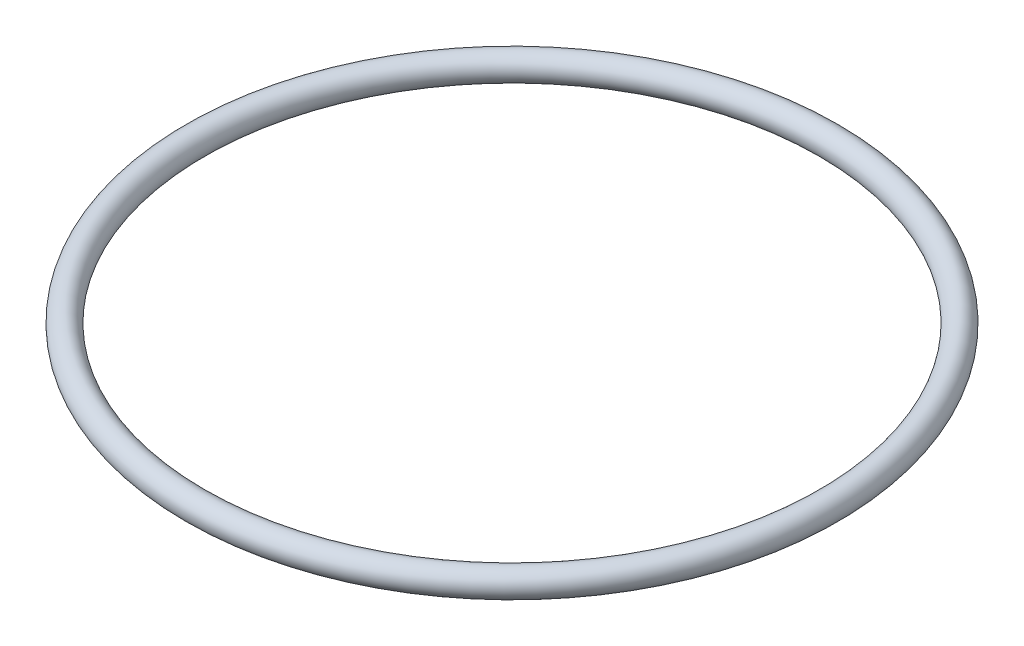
ISO-10303-21;
HEADER;
FILE_DESCRIPTION(('STEP AP214'),'2;1');
FILE_NAME('part.step','',(''),(''),'','','');
FILE_SCHEMA(('AUTOMOTIVE_DESIGN { 1 0 10303 214 1 1 1 1 }'));
ENDSEC;
DATA;
#1=APPLICATION_CONTEXT('core data for automotive mechanical design processes');
#2=APPLICATION_PROTOCOL_DEFINITION('international standard','automotive_design',2000,#1);
#3=PRODUCT_CONTEXT('',#1,'mechanical');
#4=PRODUCT('Part','Part','',(#3));
#5=PRODUCT_RELATED_PRODUCT_CATEGORY('part','',(#4));
#6=PRODUCT_DEFINITION_FORMATION('','',#4);
#7=PRODUCT_DEFINITION_CONTEXT('part definition',#1,'design');
#8=PRODUCT_DEFINITION('design','',#6,#7);
#9=PRODUCT_DEFINITION_SHAPE('','',#8);
#10=(LENGTH_UNIT() NAMED_UNIT(*) SI_UNIT(.MILLI.,.METRE.));
#11=(NAMED_UNIT(*) PLANE_ANGLE_UNIT() SI_UNIT($,.RADIAN.));
#12=(NAMED_UNIT(*) SI_UNIT($,.STERADIAN.) SOLID_ANGLE_UNIT());
#13=UNCERTAINTY_MEASURE_WITH_UNIT(LENGTH_MEASURE(1.E-05),#10,'distance_accuracy_value','');
#14=(GEOMETRIC_REPRESENTATION_CONTEXT(3) GLOBAL_UNCERTAINTY_ASSIGNED_CONTEXT((#13)) GLOBAL_UNIT_ASSIGNED_CONTEXT((#10,
#11,#12)) REPRESENTATION_CONTEXT('',''));
#15=CARTESIAN_POINT('',(0.,0.,0.));
#16=DIRECTION('',(0.,0.,1.));
#17=DIRECTION('',(1.,0.,0.));
#18=AXIS2_PLACEMENT_3D('',#15,#16,#17);
#19=CARTESIAN_POINT('',(0.,2.66499999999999,0.));
#20=DIRECTION('',(0.,-1.,0.));
#21=DIRECTION('',(0.,0.,-1.));
#22=AXIS2_PLACEMENT_3D('',#19,#20,#21);
#23=TOROIDAL_SURFACE('',#22,64.565,2.665);
#24=CARTESIAN_POINT('',(0.,2.66499999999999,-67.23));
#25=VERTEX_POINT('',#24);
#26=VERTEX_LOOP('',#25);
#27=FACE_BOUND('',#26,.T.);
#28=ADVANCED_FACE('F26',(#27),#23,.T.);
#29=CLOSED_SHELL('',(#28));
#30=MANIFOLD_SOLID_BREP('B2',#29);
#31=ADVANCED_BREP_SHAPE_REPRESENTATION('',(#18,#30),#14);
#32=SHAPE_DEFINITION_REPRESENTATION(#9,#31);
ENDSEC;
END-ISO-10303-21;
